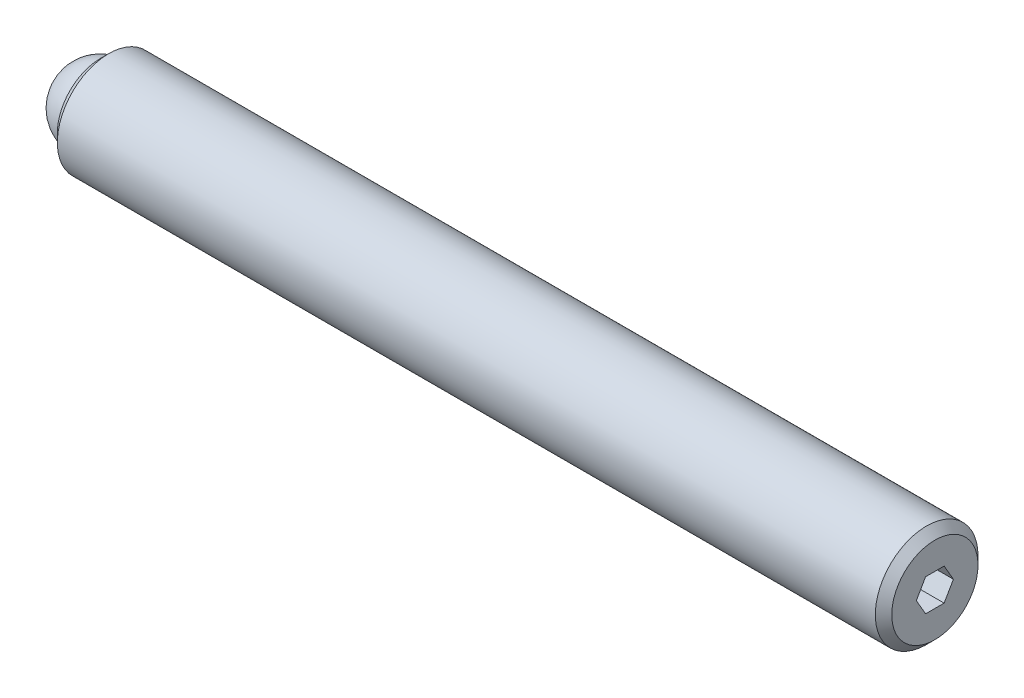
ISO-10303-21;
HEADER;
FILE_DESCRIPTION(('STEP AP214'),'2;1');
FILE_NAME('part.step','',(''),(''),'','','');
FILE_SCHEMA(('AUTOMOTIVE_DESIGN { 1 0 10303 214 1 1 1 1 }'));
ENDSEC;
DATA;
#1=APPLICATION_CONTEXT('core data for automotive mechanical design processes');
#2=APPLICATION_PROTOCOL_DEFINITION('international standard','automotive_design',2000,#1);
#3=PRODUCT_CONTEXT('',#1,'mechanical');
#4=PRODUCT('Part','Part','',(#3));
#5=PRODUCT_RELATED_PRODUCT_CATEGORY('part','',(#4));
#6=PRODUCT_DEFINITION_FORMATION('','',#4);
#7=PRODUCT_DEFINITION_CONTEXT('part definition',#1,'design');
#8=PRODUCT_DEFINITION('design','',#6,#7);
#9=PRODUCT_DEFINITION_SHAPE('','',#8);
#10=(LENGTH_UNIT() NAMED_UNIT(*) SI_UNIT(.MILLI.,.METRE.));
#11=(NAMED_UNIT(*) PLANE_ANGLE_UNIT() SI_UNIT($,.RADIAN.));
#12=(NAMED_UNIT(*) SI_UNIT($,.STERADIAN.) SOLID_ANGLE_UNIT());
#13=UNCERTAINTY_MEASURE_WITH_UNIT(LENGTH_MEASURE(1.E-05),#10,'distance_accuracy_value','');
#14=(GEOMETRIC_REPRESENTATION_CONTEXT(3) GLOBAL_UNCERTAINTY_ASSIGNED_CONTEXT((#13)) GLOBAL_UNIT_ASSIGNED_CONTEXT((#10,
#11,#12)) REPRESENTATION_CONTEXT('',''));
#15=CARTESIAN_POINT('',(0.,0.,0.));
#16=DIRECTION('',(0.,0.,1.));
#17=DIRECTION('',(1.,0.,0.));
#18=AXIS2_PLACEMENT_3D('',#15,#16,#17);
#19=CARTESIAN_POINT('',(0.,0.,0.));
#20=DIRECTION('',(0.,-1.,0.));
#21=DIRECTION('',(0.,0.,1.));
#22=AXIS2_PLACEMENT_3D('',#19,#20,#21);
#23=SPHERICAL_SURFACE('',#22,2.38125);
#24=CARTESIAN_POINT('',(0.,-2.38125,0.));
#25=VERTEX_POINT('',#24);
#26=VERTEX_LOOP('',#25);
#27=FACE_BOUND('',#26,.T.);
#28=ADVANCED_FACE('F41',(#27),#23,.T.);
#29=CLOSED_SHELL('',(#28));
#30=MANIFOLD_SOLID_BREP('B2',#29);
#31=CARTESIAN_POINT('',(51.59375,0.,0.));
#32=DIRECTION('',(-1.,0.,0.));
#33=DIRECTION('',(0.,0.,1.));
#34=AXIS2_PLACEMENT_3D('',#31,#32,#33);
#35=CYLINDRICAL_SURFACE('',#34,3.175);
#36=CARTESIAN_POINT('',(51.08575,0.,0.));
#37=DIRECTION('',(1.,0.,0.));
#38=DIRECTION('',(0.,0.,-1.));
#39=AXIS2_PLACEMENT_3D('',#36,#37,#38);
#40=CIRCLE('',#39,3.175);
#41=CARTESIAN_POINT('',(51.08575,0.,-3.175));
#42=VERTEX_POINT('',#41);
#43=EDGE_CURVE('E39',#42,#42,#40,.F.);
#44=ORIENTED_EDGE('',*,*,#43,.T.);
#45=EDGE_LOOP('',(#44));
#46=FACE_BOUND('',#45,.T.);
#47=CARTESIAN_POINT('',(0.507999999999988,0.,0.));
#48=DIRECTION('',(1.,0.,0.));
#49=DIRECTION('',(0.,0.,-1.));
#50=AXIS2_PLACEMENT_3D('',#47,#48,#49);
#51=CIRCLE('',#50,3.175);
#52=CARTESIAN_POINT('',(0.507999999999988,0.,-3.175));
#53=VERTEX_POINT('',#52);
#54=EDGE_CURVE('E157',#53,#53,#51,.T.);
#55=ORIENTED_EDGE('',*,*,#54,.T.);
#56=EDGE_LOOP('',(#55));
#57=FACE_BOUND('',#56,.T.);
#58=ADVANCED_FACE('F54',(#46,#57),#35,.T.);
#59=CARTESIAN_POINT('',(51.59375,0.,0.));
#60=DIRECTION('',(1.,0.,0.));
#61=DIRECTION('',(0.,0.,-1.));
#62=AXIS2_PLACEMENT_3D('',#59,#60,#61);
#63=PLANE('',#62);
#64=DIRECTION('',(0.,0.866025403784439,-0.5));
#65=VECTOR('',#64,1.);
#66=CARTESIAN_POINT('',(51.59375,-0.9921875,-0.572839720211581));
#67=LINE('',#66,#65);
#68=CARTESIAN_POINT('',(51.59375,-0.9921875,-0.572839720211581));
#69=VERTEX_POINT('',#68);
#70=CARTESIAN_POINT('',(51.59375,0.,-1.14567944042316));
#71=VERTEX_POINT('',#70);
#72=EDGE_CURVE('E69',#69,#71,#67,.T.);
#73=ORIENTED_EDGE('',*,*,#72,.F.);
#74=DIRECTION('',(0.,0.,-1.));
#75=VECTOR('',#74,1.);
#76=CARTESIAN_POINT('',(51.59375,-0.9921875,0.572839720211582));
#77=LINE('',#76,#75);
#78=CARTESIAN_POINT('',(51.59375,-0.9921875,0.572839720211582));
#79=VERTEX_POINT('',#78);
#80=EDGE_CURVE('E153',#79,#69,#77,.T.);
#81=ORIENTED_EDGE('',*,*,#80,.F.);
#82=DIRECTION('',(0.,-0.866025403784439,-0.5));
#83=VECTOR('',#82,1.);
#84=CARTESIAN_POINT('',(51.59375,0.,1.14567944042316));
#85=LINE('',#84,#83);
#86=CARTESIAN_POINT('',(51.59375,0.,1.14567944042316));
#87=VERTEX_POINT('',#86);
#88=EDGE_CURVE('E151',#87,#79,#85,.T.);
#89=ORIENTED_EDGE('',*,*,#88,.F.);
#90=DIRECTION('',(0.,-0.866025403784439,0.5));
#91=VECTOR('',#90,1.);
#92=CARTESIAN_POINT('',(51.59375,0.992187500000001,0.572839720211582));
#93=LINE('',#92,#91);
#94=CARTESIAN_POINT('',(51.59375,0.992187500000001,0.572839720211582));
#95=VERTEX_POINT('',#94);
#96=EDGE_CURVE('E117',#95,#87,#93,.T.);
#97=ORIENTED_EDGE('',*,*,#96,.F.);
#98=DIRECTION('',(0.,0.,1.));
#99=VECTOR('',#98,1.);
#100=CARTESIAN_POINT('',(51.59375,0.9921875,-0.572839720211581));
#101=LINE('',#100,#99);
#102=CARTESIAN_POINT('',(51.59375,0.9921875,-0.572839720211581));
#103=VERTEX_POINT('',#102);
#104=EDGE_CURVE('E147',#103,#95,#101,.T.);
#105=ORIENTED_EDGE('',*,*,#104,.F.);
#106=DIRECTION('',(0.,0.866025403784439,0.5));
#107=VECTOR('',#106,1.);
#108=CARTESIAN_POINT('',(51.59375,0.,-1.14567944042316));
#109=LINE('',#108,#107);
#110=EDGE_CURVE('E143',#71,#103,#109,.T.);
#111=ORIENTED_EDGE('',*,*,#110,.F.);
#112=EDGE_LOOP('',(#73,#81,#89,#97,#105,#111));
#113=FACE_BOUND('',#112,.T.);
#114=CARTESIAN_POINT('',(51.59375,0.,0.));
#115=DIRECTION('',(1.,0.,0.));
#116=DIRECTION('',(0.,0.,-1.));
#117=AXIS2_PLACEMENT_3D('',#114,#115,#116);
#118=CIRCLE('',#117,2.667);
#119=CARTESIAN_POINT('',(51.59375,0.,-2.667));
#120=VERTEX_POINT('',#119);
#121=EDGE_CURVE('E62',#120,#120,#118,.T.);
#122=ORIENTED_EDGE('',*,*,#121,.T.);
#123=EDGE_LOOP('',(#122));
#124=FACE_BOUND('',#123,.T.);
#125=ADVANCED_FACE('F170',(#113,#124),#63,.T.);
#126=CARTESIAN_POINT('',(0.,0.,0.));
#127=DIRECTION('',(1.,0.,0.));
#128=DIRECTION('',(0.,0.,-1.));
#129=AXIS2_PLACEMENT_3D('',#126,#127,#128);
#130=PLANE('',#129);
#131=CARTESIAN_POINT('',(0.,0.,0.));
#132=DIRECTION('',(-1.,0.,0.));
#133=DIRECTION('',(0.,0.,1.));
#134=AXIS2_PLACEMENT_3D('',#131,#132,#133);
#135=CIRCLE('',#134,2.38125);
#136=CARTESIAN_POINT('',(0.,0.,2.38125));
#137=VERTEX_POINT('',#136);
#138=EDGE_CURVE('E225',#137,#137,#135,.T.);
#139=ORIENTED_EDGE('',*,*,#138,.F.);
#140=EDGE_LOOP('',(#139));
#141=FACE_BOUND('',#140,.T.);
#142=CARTESIAN_POINT('',(0.,0.,0.));
#143=DIRECTION('',(1.,0.,0.));
#144=DIRECTION('',(0.,0.,-1.));
#145=AXIS2_PLACEMENT_3D('',#142,#143,#144);
#146=CIRCLE('',#145,2.667);
#147=CARTESIAN_POINT('',(0.,0.,-2.667));
#148=VERTEX_POINT('',#147);
#149=EDGE_CURVE('E165',#148,#148,#146,.F.);
#150=ORIENTED_EDGE('',*,*,#149,.T.);
#151=EDGE_LOOP('',(#150));
#152=FACE_BOUND('',#151,.T.);
#153=ADVANCED_FACE('F182',(#141,#152),#130,.F.);
#154=CARTESIAN_POINT('',(0.507999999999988,0.,0.));
#155=DIRECTION('',(1.,0.,0.));
#156=DIRECTION('',(0.,0.,-1.));
#157=AXIS2_PLACEMENT_3D('',#154,#155,#156);
#158=CONICAL_SURFACE('',#157,3.175,0.785398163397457);
#159=ORIENTED_EDGE('',*,*,#149,.F.);
#160=EDGE_LOOP('',(#159));
#161=FACE_BOUND('',#160,.T.);
#162=ORIENTED_EDGE('',*,*,#54,.F.);
#163=EDGE_LOOP('',(#162));
#164=FACE_BOUND('',#163,.T.);
#165=ADVANCED_FACE('F174',(#161,#164),#158,.T.);
#166=CARTESIAN_POINT('',(51.59375,0.,0.));
#167=DIRECTION('',(-1.,0.,0.));
#168=DIRECTION('',(0.,0.,1.));
#169=AXIS2_PLACEMENT_3D('',#166,#167,#168);
#170=CONICAL_SURFACE('',#169,2.667,0.785398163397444);
#171=ORIENTED_EDGE('',*,*,#43,.F.);
#172=EDGE_LOOP('',(#171));
#173=FACE_BOUND('',#172,.T.);
#174=ORIENTED_EDGE('',*,*,#121,.F.);
#175=EDGE_LOOP('',(#174));
#176=FACE_BOUND('',#175,.T.);
#177=ADVANCED_FACE('F56',(#173,#176),#170,.T.);
#178=CARTESIAN_POINT('',(49.30775,-0.9921875,-0.572839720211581));
#179=DIRECTION('',(0.,-0.5,-0.866025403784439));
#180=DIRECTION('',(0.,0.866025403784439,-0.5));
#181=AXIS2_PLACEMENT_3D('',#178,#179,#180);
#182=PLANE('',#181);
#183=ORIENTED_EDGE('',*,*,#72,.T.);
#184=DIRECTION('',(1.,0.,0.));
#185=VECTOR('',#184,1.);
#186=CARTESIAN_POINT('',(49.30775,0.,-1.14567944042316));
#187=LINE('',#186,#185);
#188=CARTESIAN_POINT('',(49.30775,0.,-1.14567944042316));
#189=VERTEX_POINT('',#188);
#190=EDGE_CURVE('E99',#189,#71,#187,.T.);
#191=ORIENTED_EDGE('',*,*,#190,.F.);
#192=DIRECTION('',(0.,0.866025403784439,-0.5));
#193=VECTOR('',#192,1.);
#194=CARTESIAN_POINT('',(49.30775,-0.9921875,-0.572839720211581));
#195=LINE('',#194,#193);
#196=CARTESIAN_POINT('',(49.30775,-0.9921875,-0.572839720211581));
#197=VERTEX_POINT('',#196);
#198=EDGE_CURVE('E155',#197,#189,#195,.T.);
#199=ORIENTED_EDGE('',*,*,#198,.F.);
#200=DIRECTION('',(1.,0.,0.));
#201=VECTOR('',#200,1.);
#202=CARTESIAN_POINT('',(49.30775,-0.9921875,-0.572839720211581));
#203=LINE('',#202,#201);
#204=EDGE_CURVE('E77',#197,#69,#203,.T.);
#205=ORIENTED_EDGE('',*,*,#204,.T.);
#206=EDGE_LOOP('',(#183,#191,#199,#205));
#207=FACE_BOUND('',#206,.T.);
#208=ADVANCED_FACE('F173',(#207),#182,.F.);
#209=CARTESIAN_POINT('',(49.30775,-0.9921875,0.572839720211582));
#210=DIRECTION('',(0.,-1.,0.));
#211=DIRECTION('',(0.,0.,-1.));
#212=AXIS2_PLACEMENT_3D('',#209,#210,#211);
#213=PLANE('',#212);
#214=ORIENTED_EDGE('',*,*,#80,.T.);
#215=ORIENTED_EDGE('',*,*,#204,.F.);
#216=DIRECTION('',(0.,0.,-1.));
#217=VECTOR('',#216,1.);
#218=CARTESIAN_POINT('',(49.30775,-0.9921875,0.572839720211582));
#219=LINE('',#218,#217);
#220=CARTESIAN_POINT('',(49.30775,-0.9921875,0.572839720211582));
#221=VERTEX_POINT('',#220);
#222=EDGE_CURVE('E129',#221,#197,#219,.T.);
#223=ORIENTED_EDGE('',*,*,#222,.F.);
#224=DIRECTION('',(1.,0.,0.));
#225=VECTOR('',#224,1.);
#226=CARTESIAN_POINT('',(49.30775,-0.9921875,0.572839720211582));
#227=LINE('',#226,#225);
#228=EDGE_CURVE('E121',#221,#79,#227,.T.);
#229=ORIENTED_EDGE('',*,*,#228,.T.);
#230=EDGE_LOOP('',(#214,#215,#223,#229));
#231=FACE_BOUND('',#230,.T.);
#232=ADVANCED_FACE('F180',(#231),#213,.F.);
#233=CARTESIAN_POINT('',(49.30775,0.,1.14567944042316));
#234=DIRECTION('',(0.,-0.5,0.866025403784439));
#235=DIRECTION('',(0.,-0.866025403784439,-0.5));
#236=AXIS2_PLACEMENT_3D('',#233,#234,#235);
#237=PLANE('',#236);
#238=ORIENTED_EDGE('',*,*,#88,.T.);
#239=ORIENTED_EDGE('',*,*,#228,.F.);
#240=DIRECTION('',(0.,-0.866025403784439,-0.5));
#241=VECTOR('',#240,1.);
#242=CARTESIAN_POINT('',(49.30775,0.,1.14567944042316));
#243=LINE('',#242,#241);
#244=CARTESIAN_POINT('',(49.30775,0.,1.14567944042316));
#245=VERTEX_POINT('',#244);
#246=EDGE_CURVE('E125',#245,#221,#243,.T.);
#247=ORIENTED_EDGE('',*,*,#246,.F.);
#248=DIRECTION('',(1.,0.,0.));
#249=VECTOR('',#248,1.);
#250=CARTESIAN_POINT('',(49.30775,0.,1.14567944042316));
#251=LINE('',#250,#249);
#252=EDGE_CURVE('E110',#245,#87,#251,.T.);
#253=ORIENTED_EDGE('',*,*,#252,.T.);
#254=EDGE_LOOP('',(#238,#239,#247,#253));
#255=FACE_BOUND('',#254,.T.);
#256=ADVANCED_FACE('F126',(#255),#237,.F.);
#257=CARTESIAN_POINT('',(49.30775,0.992187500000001,0.572839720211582));
#258=DIRECTION('',(0.,0.5,0.866025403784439));
#259=DIRECTION('',(0.,-0.866025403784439,0.5));
#260=AXIS2_PLACEMENT_3D('',#257,#258,#259);
#261=PLANE('',#260);
#262=ORIENTED_EDGE('',*,*,#96,.T.);
#263=ORIENTED_EDGE('',*,*,#252,.F.);
#264=DIRECTION('',(0.,-0.866025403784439,0.5));
#265=VECTOR('',#264,1.);
#266=CARTESIAN_POINT('',(49.30775,0.992187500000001,0.572839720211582));
#267=LINE('',#266,#265);
#268=CARTESIAN_POINT('',(49.30775,0.992187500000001,0.572839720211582));
#269=VERTEX_POINT('',#268);
#270=EDGE_CURVE('E114',#269,#245,#267,.T.);
#271=ORIENTED_EDGE('',*,*,#270,.F.);
#272=DIRECTION('',(1.,0.,0.));
#273=VECTOR('',#272,1.);
#274=CARTESIAN_POINT('',(49.30775,0.992187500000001,0.572839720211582));
#275=LINE('',#274,#273);
#276=EDGE_CURVE('E122',#269,#95,#275,.T.);
#277=ORIENTED_EDGE('',*,*,#276,.T.);
#278=EDGE_LOOP('',(#262,#263,#271,#277));
#279=FACE_BOUND('',#278,.T.);
#280=ADVANCED_FACE('F112',(#279),#261,.F.);
#281=CARTESIAN_POINT('',(49.30775,0.9921875,-0.572839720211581));
#282=DIRECTION('',(0.,1.,0.));
#283=DIRECTION('',(0.,0.,1.));
#284=AXIS2_PLACEMENT_3D('',#281,#282,#283);
#285=PLANE('',#284);
#286=ORIENTED_EDGE('',*,*,#104,.T.);
#287=ORIENTED_EDGE('',*,*,#276,.F.);
#288=DIRECTION('',(0.,0.,1.));
#289=VECTOR('',#288,1.);
#290=CARTESIAN_POINT('',(49.30775,0.9921875,-0.572839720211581));
#291=LINE('',#290,#289);
#292=CARTESIAN_POINT('',(49.30775,0.9921875,-0.572839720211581));
#293=VERTEX_POINT('',#292);
#294=EDGE_CURVE('E135',#293,#269,#291,.T.);
#295=ORIENTED_EDGE('',*,*,#294,.F.);
#296=DIRECTION('',(1.,0.,0.));
#297=VECTOR('',#296,1.);
#298=CARTESIAN_POINT('',(49.30775,0.9921875,-0.572839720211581));
#299=LINE('',#298,#297);
#300=EDGE_CURVE('E160',#293,#103,#299,.T.);
#301=ORIENTED_EDGE('',*,*,#300,.T.);
#302=EDGE_LOOP('',(#286,#287,#295,#301));
#303=FACE_BOUND('',#302,.T.);
#304=ADVANCED_FACE('F201',(#303),#285,.F.);
#305=CARTESIAN_POINT('',(49.30775,0.,-1.14567944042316));
#306=DIRECTION('',(0.,0.5,-0.866025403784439));
#307=DIRECTION('',(0.,0.866025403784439,0.5));
#308=AXIS2_PLACEMENT_3D('',#305,#306,#307);
#309=PLANE('',#308);
#310=ORIENTED_EDGE('',*,*,#110,.T.);
#311=ORIENTED_EDGE('',*,*,#300,.F.);
#312=DIRECTION('',(0.,0.866025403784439,0.5));
#313=VECTOR('',#312,1.);
#314=CARTESIAN_POINT('',(49.30775,0.,-1.14567944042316));
#315=LINE('',#314,#313);
#316=EDGE_CURVE('E137',#189,#293,#315,.T.);
#317=ORIENTED_EDGE('',*,*,#316,.F.);
#318=ORIENTED_EDGE('',*,*,#190,.T.);
#319=EDGE_LOOP('',(#310,#311,#317,#318));
#320=FACE_BOUND('',#319,.T.);
#321=ADVANCED_FACE('F198',(#320),#309,.F.);
#322=CARTESIAN_POINT('',(49.30775,0.,0.));
#323=DIRECTION('',(1.,0.,0.));
#324=DIRECTION('',(0.,0.,-1.));
#325=AXIS2_PLACEMENT_3D('',#322,#323,#324);
#326=PLANE('',#325);
#327=ORIENTED_EDGE('',*,*,#198,.T.);
#328=ORIENTED_EDGE('',*,*,#316,.T.);
#329=ORIENTED_EDGE('',*,*,#294,.T.);
#330=ORIENTED_EDGE('',*,*,#270,.T.);
#331=ORIENTED_EDGE('',*,*,#246,.T.);
#332=ORIENTED_EDGE('',*,*,#222,.T.);
#333=EDGE_LOOP('',(#327,#328,#329,#330,#331,#332));
#334=FACE_BOUND('',#333,.T.);
#335=ADVANCED_FACE('F132',(#334),#326,.T.);
#336=CARTESIAN_POINT('',(1.984375,0.,0.));
#337=DIRECTION('',(-1.,0.,0.));
#338=DIRECTION('',(0.,0.,1.));
#339=AXIS2_PLACEMENT_3D('',#336,#337,#338);
#340=CYLINDRICAL_SURFACE('',#339,2.38125);
#341=CARTESIAN_POINT('',(1.984375,0.,0.));
#342=DIRECTION('',(-1.,0.,0.));
#343=DIRECTION('',(0.,0.,1.));
#344=AXIS2_PLACEMENT_3D('',#341,#342,#343);
#345=CIRCLE('',#344,2.38125);
#346=CARTESIAN_POINT('',(1.984375,0.,2.38125));
#347=VERTEX_POINT('',#346);
#348=EDGE_CURVE('E144',#347,#347,#345,.T.);
#349=ORIENTED_EDGE('',*,*,#348,.F.);
#350=EDGE_LOOP('',(#349));
#351=FACE_BOUND('',#350,.T.);
#352=ORIENTED_EDGE('',*,*,#138,.T.);
#353=EDGE_LOOP('',(#352));
#354=FACE_BOUND('',#353,.T.);
#355=ADVANCED_FACE('F214',(#351,#354),#340,.F.);
#356=CARTESIAN_POINT('',(1.984375,0.,0.));
#357=DIRECTION('',(-1.,0.,0.));
#358=DIRECTION('',(0.,0.,1.));
#359=AXIS2_PLACEMENT_3D('',#356,#357,#358);
#360=PLANE('',#359);
#361=ORIENTED_EDGE('',*,*,#348,.T.);
#362=EDGE_LOOP('',(#361));
#363=FACE_BOUND('',#362,.T.);
#364=ADVANCED_FACE('F217',(#363),#360,.T.);
#365=CLOSED_SHELL('',(#58,#125,#153,#165,#177,#208,#232,#256,#280,#304,#321,#335,#355,#364));
#366=MANIFOLD_SOLID_BREP('B6',#365);
#367=ADVANCED_BREP_SHAPE_REPRESENTATION('',(#18,#30,#366),#14);
#368=SHAPE_DEFINITION_REPRESENTATION(#9,#367);
ENDSEC;
END-ISO-10303-21;
